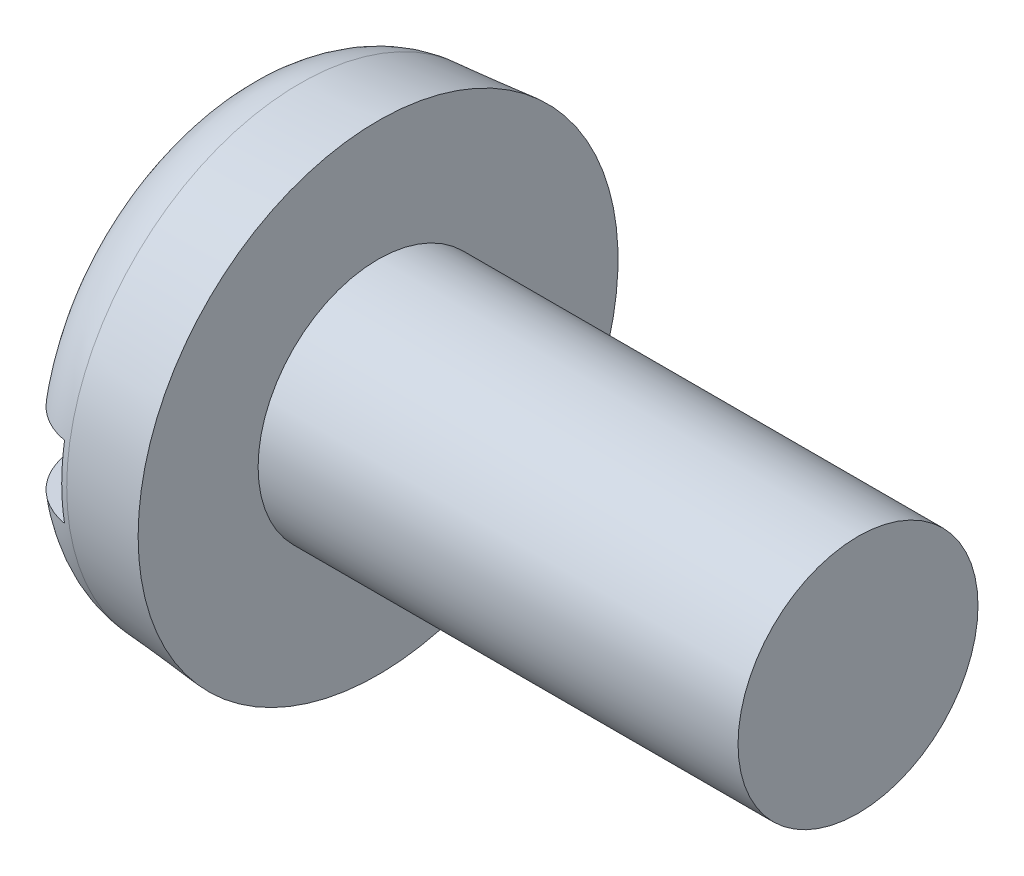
ISO-10303-21;
HEADER;
FILE_DESCRIPTION(('STEP AP214'),'2;1');
FILE_NAME('part.step','',(''),(''),'','','');
FILE_SCHEMA(('AUTOMOTIVE_DESIGN { 1 0 10303 214 1 1 1 1 }'));
ENDSEC;
DATA;
#1=APPLICATION_CONTEXT('core data for automotive mechanical design processes');
#2=APPLICATION_PROTOCOL_DEFINITION('international standard','automotive_design',2000,#1);
#3=PRODUCT_CONTEXT('',#1,'mechanical');
#4=PRODUCT('Part','Part','',(#3));
#5=PRODUCT_RELATED_PRODUCT_CATEGORY('part','',(#4));
#6=PRODUCT_DEFINITION_FORMATION('','',#4);
#7=PRODUCT_DEFINITION_CONTEXT('part definition',#1,'design');
#8=PRODUCT_DEFINITION('design','',#6,#7);
#9=PRODUCT_DEFINITION_SHAPE('','',#8);
#10=(LENGTH_UNIT() NAMED_UNIT(*) SI_UNIT(.MILLI.,.METRE.));
#11=(NAMED_UNIT(*) PLANE_ANGLE_UNIT() SI_UNIT($,.RADIAN.));
#12=(NAMED_UNIT(*) SI_UNIT($,.STERADIAN.) SOLID_ANGLE_UNIT());
#13=UNCERTAINTY_MEASURE_WITH_UNIT(LENGTH_MEASURE(1.E-05),#10,'distance_accuracy_value','');
#14=(GEOMETRIC_REPRESENTATION_CONTEXT(3) GLOBAL_UNCERTAINTY_ASSIGNED_CONTEXT((#13)) GLOBAL_UNIT_ASSIGNED_CONTEXT((#10,
#11,#12)) REPRESENTATION_CONTEXT('',''));
#15=CARTESIAN_POINT('',(0.,0.,0.));
#16=DIRECTION('',(0.,0.,1.));
#17=DIRECTION('',(1.,0.,0.));
#18=AXIS2_PLACEMENT_3D('',#15,#16,#17);
#19=CARTESIAN_POINT('',(0.,0.,0.));
#20=DIRECTION('',(-1.,0.,0.));
#21=DIRECTION('',(0.,0.,1.));
#22=AXIS2_PLACEMENT_3D('',#19,#20,#21);
#23=PLANE('',#22);
#24=DIRECTION('',(0.,0.,-1.));
#25=VECTOR('',#24,1.);
#26=CARTESIAN_POINT('',(0.,0.599999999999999,4.));
#27=LINE('',#26,#25);
#28=CARTESIAN_POINT('',(0.,0.599999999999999,2.62267277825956));
#29=VERTEX_POINT('',#28);
#30=CARTESIAN_POINT('',(0.,0.599999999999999,-2.62267277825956));
#31=VERTEX_POINT('',#30);
#32=EDGE_CURVE('E85',#29,#31,#27,.T.);
#33=ORIENTED_EDGE('',*,*,#32,.F.);
#34=CARTESIAN_POINT('',(0.,0.,0.));
#35=DIRECTION('',(-1.,0.,0.));
#36=DIRECTION('',(0.,0.,1.));
#37=AXIS2_PLACEMENT_3D('',#34,#35,#36);
#38=CIRCLE('',#37,2.69042979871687);
#39=EDGE_CURVE('E91',#29,#31,#38,.T.);
#40=ORIENTED_EDGE('',*,*,#39,.T.);
#41=EDGE_LOOP('',(#33,#40));
#42=FACE_BOUND('',#41,.T.);
#43=ADVANCED_FACE('F32',(#42),#23,.T.);
#44=CARTESIAN_POINT('',(-25.4,0.,0.));
#45=DIRECTION('',(-1.,0.,0.));
#46=DIRECTION('',(0.,0.,1.));
#47=AXIS2_PLACEMENT_3D('',#44,#45,#46);
#48=CYLINDRICAL_SURFACE('',#47,2.);
#49=CARTESIAN_POINT('',(10.4,0.,0.));
#50=DIRECTION('',(-1.,0.,0.));
#51=DIRECTION('',(0.,0.,1.));
#52=AXIS2_PLACEMENT_3D('',#49,#50,#51);
#53=CIRCLE('',#52,2.);
#54=CARTESIAN_POINT('',(10.4,0.,2.));
#55=VERTEX_POINT('',#54);
#56=EDGE_CURVE('E92',#55,#55,#53,.T.);
#57=ORIENTED_EDGE('',*,*,#56,.T.);
#58=EDGE_LOOP('',(#57));
#59=FACE_BOUND('',#58,.T.);
#60=CARTESIAN_POINT('',(2.4,0.,0.));
#61=DIRECTION('',(-1.,0.,0.));
#62=DIRECTION('',(0.,0.,1.));
#63=AXIS2_PLACEMENT_3D('',#60,#61,#62);
#64=CIRCLE('',#63,2.);
#65=CARTESIAN_POINT('',(2.4,0.,2.));
#66=VERTEX_POINT('',#65);
#67=EDGE_CURVE('E149',#66,#66,#64,.T.);
#68=ORIENTED_EDGE('',*,*,#67,.F.);
#69=EDGE_LOOP('',(#68));
#70=FACE_BOUND('',#69,.T.);
#71=ADVANCED_FACE('F137',(#59,#70),#48,.T.);
#72=CARTESIAN_POINT('',(10.4,2.,0.));
#73=DIRECTION('',(1.,0.,0.));
#74=DIRECTION('',(0.,0.,-1.));
#75=AXIS2_PLACEMENT_3D('',#72,#73,#74);
#76=PLANE('',#75);
#77=ORIENTED_EDGE('',*,*,#56,.F.);
#78=EDGE_LOOP('',(#77));
#79=FACE_BOUND('',#78,.T.);
#80=ADVANCED_FACE('F135',(#79),#76,.T.);
#81=DIRECTION('',(0.,0.,1.));
#82=VECTOR('',#81,1.);
#83=CARTESIAN_POINT('',(0.,-0.599999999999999,-4.));
#84=LINE('',#83,#82);
#85=CARTESIAN_POINT('',(0.,-0.6,-2.62267277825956));
#86=VERTEX_POINT('',#85);
#87=CARTESIAN_POINT('',(0.,-0.6,2.62267277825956));
#88=VERTEX_POINT('',#87);
#89=EDGE_CURVE('E76',#86,#88,#84,.T.);
#90=ORIENTED_EDGE('',*,*,#89,.F.);
#91=EDGE_CURVE('E83',#86,#88,#38,.T.);
#92=ORIENTED_EDGE('',*,*,#91,.T.);
#93=EDGE_LOOP('',(#90,#92));
#94=FACE_BOUND('',#93,.T.);
#95=ADVANCED_FACE('F82',(#94),#23,.T.);
#96=CARTESIAN_POINT('',(0.,0.,0.));
#97=DIRECTION('',(1.,0.,0.));
#98=DIRECTION('',(0.,0.,-1.));
#99=AXIS2_PLACEMENT_3D('',#96,#97,#98);
#100=CONICAL_SURFACE('',#99,3.79002720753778,0.0872664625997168);
#101=CARTESIAN_POINT('',(1.09541310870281,0.,0.));
#102=DIRECTION('',(-1.,0.,0.));
#103=DIRECTION('',(0.,0.,1.));
#104=AXIS2_PLACEMENT_3D('',#101,#102,#103);
#105=CIRCLE('',#104,3.88586343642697);
#106=CARTESIAN_POINT('',(1.09541310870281,0.,3.88586343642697));
#107=VERTEX_POINT('',#106);
#108=EDGE_CURVE('E95',#107,#107,#105,.F.);
#109=ORIENTED_EDGE('',*,*,#108,.T.);
#110=EDGE_LOOP('',(#109));
#111=FACE_BOUND('',#110,.T.);
#112=CARTESIAN_POINT('',(2.4,0.,0.));
#113=DIRECTION('',(-1.,0.,0.));
#114=DIRECTION('',(0.,0.,1.));
#115=AXIS2_PLACEMENT_3D('',#112,#113,#114);
#116=CIRCLE('',#115,4.);
#117=CARTESIAN_POINT('',(2.4,0.,4.));
#118=VERTEX_POINT('',#117);
#119=EDGE_CURVE('E97',#118,#118,#116,.T.);
#120=ORIENTED_EDGE('',*,*,#119,.T.);
#121=EDGE_LOOP('',(#120));
#122=FACE_BOUND('',#121,.T.);
#123=ADVANCED_FACE('F128',(#111,#122),#100,.T.);
#124=CARTESIAN_POINT('',(2.4,2.,0.));
#125=DIRECTION('',(-1.,0.,0.));
#126=DIRECTION('',(0.,0.,1.));
#127=AXIS2_PLACEMENT_3D('',#124,#125,#126);
#128=PLANE('',#127);
#129=ORIENTED_EDGE('',*,*,#119,.F.);
#130=EDGE_LOOP('',(#129));
#131=FACE_BOUND('',#130,.T.);
#132=ORIENTED_EDGE('',*,*,#67,.T.);
#133=EDGE_LOOP('',(#132));
#134=FACE_BOUND('',#133,.T.);
#135=ADVANCED_FACE('F124',(#131,#134),#128,.F.);
#136=CARTESIAN_POINT('',(1.2,0.,0.));
#137=DIRECTION('',(-1.,0.,0.));
#138=DIRECTION('',(0.,0.,1.));
#139=AXIS2_PLACEMENT_3D('',#136,#137,#138);
#140=TOROIDAL_SURFACE('',#139,2.69042979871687,1.2);
#141=CARTESIAN_POINT('',(0.3865043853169,0.599999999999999,-3.52185650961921));
#142=CARTESIAN_POINT('',(0.435468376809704,0.599999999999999,-3.56765543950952));
#143=CARTESIAN_POINT('',(0.48830443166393,0.599999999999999,-3.60938194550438));
#144=CARTESIAN_POINT('',(0.600265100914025,0.599999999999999,-3.68342203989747));
#145=CARTESIAN_POINT('',(0.659396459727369,0.599999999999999,-3.71572539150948));
#146=CARTESIAN_POINT('',(0.782252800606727,0.599999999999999,-3.76991557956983));
#147=CARTESIAN_POINT('',(0.845977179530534,0.599999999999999,-3.79180378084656));
#148=CARTESIAN_POINT('',(0.976191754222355,0.599999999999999,-3.82450279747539));
#149=CARTESIAN_POINT('',(1.04268130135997,0.599999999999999,-3.83531619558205));
#150=CARTESIAN_POINT('',(1.1761990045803,0.599999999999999,-3.84552483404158));
#151=CARTESIAN_POINT('',(1.2432228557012,0.599999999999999,-3.84497642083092));
#152=CARTESIAN_POINT('',(1.37622462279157,0.599999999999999,-3.83261582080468));
#153=CARTESIAN_POINT('',(1.44220252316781,0.599999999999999,-3.82080346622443));
#154=CARTESIAN_POINT('',(1.57113854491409,0.599999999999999,-3.7862937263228));
#155=CARTESIAN_POINT('',(1.63410108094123,0.599999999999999,-3.76361282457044));
#156=CARTESIAN_POINT('',(1.75534617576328,0.599999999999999,-3.70804459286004));
#157=CARTESIAN_POINT('',(1.81362870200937,0.599999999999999,-3.67515719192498));
#158=CARTESIAN_POINT('',(1.92413366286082,0.599999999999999,-3.5999836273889));
#159=CARTESIAN_POINT('',(1.97632984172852,0.599999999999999,-3.55765888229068));
#160=CARTESIAN_POINT('',(2.07296076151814,0.599999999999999,-3.46492588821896));
#161=CARTESIAN_POINT('',(2.11739523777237,0.599999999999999,-3.4145173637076));
#162=CARTESIAN_POINT('',(2.19773705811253,0.599999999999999,-3.30652404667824));
#163=CARTESIAN_POINT('',(2.2335546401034,0.599999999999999,-3.24887250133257));
#164=CARTESIAN_POINT('',(2.29517588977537,0.599999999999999,-3.12844912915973));
#165=CARTESIAN_POINT('',(2.32097889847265,0.599999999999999,-3.06567696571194));
#166=CARTESIAN_POINT('',(2.36230436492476,0.599999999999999,-2.93572304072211));
#167=CARTESIAN_POINT('',(2.37765465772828,0.599999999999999,-2.86848656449));
#168=CARTESIAN_POINT('',(2.39710654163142,0.599999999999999,-2.73240889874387));
#169=CARTESIAN_POINT('',(2.40120699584,0.599999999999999,-2.66356754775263));
#170=CARTESIAN_POINT('',(2.39814758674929,0.599999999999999,-2.52464946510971));
#171=CARTESIAN_POINT('',(2.39074269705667,0.599999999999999,-2.45457815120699));
#172=CARTESIAN_POINT('',(2.36454808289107,0.599999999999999,-2.31659764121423));
#173=CARTESIAN_POINT('',(2.34575688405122,0.599999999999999,-2.24868872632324));
#174=CARTESIAN_POINT('',(2.29682890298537,0.599999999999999,-2.11531585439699));
#175=CARTESIAN_POINT('',(2.26644200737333,0.599999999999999,-2.04994358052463));
#176=CARTESIAN_POINT('',(2.19524076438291,0.599999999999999,-1.92513363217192));
#177=CARTESIAN_POINT('',(2.15442449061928,0.599999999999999,-1.86569705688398));
#178=CARTESIAN_POINT('',(2.06294283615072,0.599999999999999,-1.75389115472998));
#179=CARTESIAN_POINT('',(2.01217853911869,0.599999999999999,-1.70160258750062));
#180=CARTESIAN_POINT('',(1.90235992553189,0.599999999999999,-1.60657192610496));
#181=CARTESIAN_POINT('',(1.84330597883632,0.599999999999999,-1.56382940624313));
#182=CARTESIAN_POINT('',(1.72028944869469,0.599999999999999,-1.49071034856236));
#183=CARTESIAN_POINT('',(1.65652070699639,0.599999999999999,-1.46000898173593));
#184=CARTESIAN_POINT('',(1.52445964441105,0.599999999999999,-1.41076217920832));
#185=CARTESIAN_POINT('',(1.45617085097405,0.599999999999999,-1.39220738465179));
#186=CARTESIAN_POINT('',(1.32258878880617,0.599999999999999,-1.3692588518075));
#187=CARTESIAN_POINT('',(1.25746124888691,0.599999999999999,-1.36389765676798));
#188=CARTESIAN_POINT('',(1.12729576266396,0.599999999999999,-1.36480396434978));
#189=CARTESIAN_POINT('',(1.06225779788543,0.599999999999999,-1.37106853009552));
#190=CARTESIAN_POINT('',(0.937361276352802,0.599999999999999,-1.39427975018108));
#191=CARTESIAN_POINT('',(0.877403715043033,0.599999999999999,-1.41070181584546));
#192=CARTESIAN_POINT('',(0.760914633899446,0.599999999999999,-1.45296891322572));
#193=CARTESIAN_POINT('',(0.704383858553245,0.599999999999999,-1.47881598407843));
#194=CARTESIAN_POINT('',(0.59370506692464,0.599999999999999,-1.54020998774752));
#195=CARTESIAN_POINT('',(0.539760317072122,0.599999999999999,-1.57612236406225));
#196=CARTESIAN_POINT('',(0.438104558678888,0.599999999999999,-1.65588570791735));
#197=CARTESIAN_POINT('',(0.390395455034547,0.599999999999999,-1.69973909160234));
#198=CARTESIAN_POINT('',(0.298820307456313,0.599999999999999,-1.79776253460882));
#199=CARTESIAN_POINT('',(0.255521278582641,0.599999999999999,-1.85246315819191));
#200=CARTESIAN_POINT('',(0.178283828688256,0.599999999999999,-1.96812037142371));
#201=CARTESIAN_POINT('',(0.144347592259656,0.599999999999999,-2.02907841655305));
#202=CARTESIAN_POINT('',(0.0855336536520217,0.599999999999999,-2.15824220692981));
#203=CARTESIAN_POINT('',(0.0610804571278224,0.599999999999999,-2.22664188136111));
#204=CARTESIAN_POINT('',(0.0240295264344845,0.599999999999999,-2.36658228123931));
#205=CARTESIAN_POINT('',(0.0114315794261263,0.599999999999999,-2.43812295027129));
#206=CARTESIAN_POINT('',(-0.00140349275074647,0.599999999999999,-2.58214276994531));
#207=CARTESIAN_POINT('',(-0.00166960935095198,0.599999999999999,-2.65461931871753));
#208=CARTESIAN_POINT('',(0.0102529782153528,0.599999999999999,-2.79856484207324));
#209=CARTESIAN_POINT('',(0.0224436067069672,0.599999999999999,-2.87003365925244));
#210=CARTESIAN_POINT('',(0.0586721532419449,0.599999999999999,-3.00828260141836));
#211=CARTESIAN_POINT('',(0.082454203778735,0.599999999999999,-3.07512990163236));
#212=CARTESIAN_POINT('',(0.141152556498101,0.599999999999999,-3.20367573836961));
#213=CARTESIAN_POINT('',(0.176053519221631,0.599999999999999,-3.26538122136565));
#214=CARTESIAN_POINT('',(0.240740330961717,0.599999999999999,-3.35956174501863));
#215=CARTESIAN_POINT('',(0.267410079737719,0.599999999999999,-3.39421743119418));
#216=CARTESIAN_POINT('',(0.324340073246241,0.599999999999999,-3.46044388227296));
#217=CARTESIAN_POINT('',(0.354600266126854,0.599999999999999,-3.49201469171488));
#218=CARTESIAN_POINT('',(0.3865043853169,0.599999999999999,-3.52185650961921));
#219=B_SPLINE_CURVE_WITH_KNOTS('',3,(#141,#142,#143,#144,#145,#146,#147,#148,#149,#150,#151,
#152,#153,#154,#155,#156,#157,#158,#159,#160,#161,#162,#163,#164,#165,#166,#167,#168,#169,#170,
#171,#172,#173,#174,#175,#176,#177,#178,#179,#180,#181,#182,#183,#184,#185,#186,#187,#188,#189,
#190,#191,#192,#193,#194,#195,#196,#197,#198,#199,#200,#201,#202,#203,#204,#205,#206,#207,#208,
#209,#210,#211,#212,#213,#214,#215,#216,#217,#218),.UNSPECIFIED.,.T.,.F.,(4,2,2,2,2,2,2,2,2,2,2,
2,2,2,2,2,2,2,2,2,2,2,2,2,2,2,2,2,2,2,2,2,2,2,2,2,2,2,4),(0.,0.200976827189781,
0.402171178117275,0.603339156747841,0.804460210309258,1.0045840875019,1.2047109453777,
1.40453524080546,1.60436092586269,1.80501901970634,2.00568395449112,2.2083565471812,
2.41104247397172,2.61699090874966,2.82296015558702,3.03337636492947,3.24381982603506,
3.45908552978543,3.67439102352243,3.8919572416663,4.10951375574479,4.32071351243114,
4.53175034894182,4.72677835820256,4.92175710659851,5.10742155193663,5.29312619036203,
5.48672044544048,5.68037370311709,5.88873369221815,6.09714225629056,6.31402614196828,
6.53090613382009,6.74727622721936,6.96367975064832,7.17550906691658,7.38704740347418,
7.51800243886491,7.64895558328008),.UNSPECIFIED.);
#220=CARTESIAN_POINT('',(1.,0.599999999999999,-3.8268957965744));
#221=VERTEX_POINT('',#220);
#222=EDGE_CURVE('E11',#31,#221,#219,.T.);
#223=ORIENTED_EDGE('',*,*,#222,.F.);
#224=ORIENTED_EDGE('',*,*,#39,.F.);
#225=CARTESIAN_POINT('',(0.568676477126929,0.599999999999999,1.55841219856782));
#226=CARTESIAN_POINT('',(0.622454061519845,0.599999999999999,1.52276443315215));
#227=CARTESIAN_POINT('',(0.679085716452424,0.599999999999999,1.49137245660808));
#228=CARTESIAN_POINT('',(0.796770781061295,0.599999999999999,1.43831139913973));
#229=CARTESIAN_POINT('',(0.857825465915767,0.599999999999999,1.41664513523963));
#230=CARTESIAN_POINT('',(0.982921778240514,0.599999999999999,1.38402811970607));
#231=CARTESIAN_POINT('',(1.04697051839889,0.599999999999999,1.37310440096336));
#232=CARTESIAN_POINT('',(1.17597937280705,0.599999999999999,1.36268675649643));
#233=CARTESIAN_POINT('',(1.24093916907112,0.599999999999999,1.36318893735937));
#234=CARTESIAN_POINT('',(1.36722529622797,0.599999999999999,1.37533615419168));
#235=CARTESIAN_POINT('',(1.42859438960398,0.599999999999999,1.38654477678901));
#236=CARTESIAN_POINT('',(1.54865022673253,0.599999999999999,1.41889802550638));
#237=CARTESIAN_POINT('',(1.60733638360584,0.599999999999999,1.44004481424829));
#238=CARTESIAN_POINT('',(1.72180457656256,0.599999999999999,1.49189888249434));
#239=CARTESIAN_POINT('',(1.77749881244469,0.599999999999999,1.52279911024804));
#240=CARTESIAN_POINT('',(1.88340638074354,0.599999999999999,1.59287167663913));
#241=CARTESIAN_POINT('',(1.93361816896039,0.599999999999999,1.63204633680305));
#242=CARTESIAN_POINT('',(2.03113053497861,0.599999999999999,1.7207614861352));
#243=CARTESIAN_POINT('',(2.07792119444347,0.599999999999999,1.77086293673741));
#244=CARTESIAN_POINT('',(2.16295007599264,0.599999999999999,1.87786529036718));
#245=CARTESIAN_POINT('',(2.20118595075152,0.599999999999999,1.93476805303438));
#246=CARTESIAN_POINT('',(2.26997158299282,0.599999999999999,2.05705672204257));
#247=CARTESIAN_POINT('',(2.30000838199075,0.599999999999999,2.12273201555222));
#248=CARTESIAN_POINT('',(2.34872218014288,0.599999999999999,2.25817360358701));
#249=CARTESIAN_POINT('',(2.36739836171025,0.599999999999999,2.32794019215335));
#250=CARTESIAN_POINT('',(2.39284815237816,0.599999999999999,2.47012141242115));
#251=CARTESIAN_POINT('',(2.3995382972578,0.599999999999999,2.54255105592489));
#252=CARTESIAN_POINT('',(2.40041533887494,0.599999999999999,2.68749005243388));
#253=CARTESIAN_POINT('',(2.39460324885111,0.599999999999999,2.75999939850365));
#254=CARTESIAN_POINT('',(2.37072428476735,0.599999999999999,2.90156578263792));
#255=CARTESIAN_POINT('',(2.35289092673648,0.599999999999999,2.97066215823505));
#256=CARTESIAN_POINT('',(2.3055955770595,0.599999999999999,3.10475609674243));
#257=CARTESIAN_POINT('',(2.2761350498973,0.599999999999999,3.16975417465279));
#258=CARTESIAN_POINT('',(2.20718370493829,0.599999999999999,3.29217559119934));
#259=CARTESIAN_POINT('',(2.16794580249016,0.599999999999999,3.34974141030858));
#260=CARTESIAN_POINT('',(2.08018656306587,0.599999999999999,3.45730019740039));
#261=CARTESIAN_POINT('',(2.03166624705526,0.599999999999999,3.50729399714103));
#262=CARTESIAN_POINT('',(1.92773605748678,0.599999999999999,3.59728886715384));
#263=CARTESIAN_POINT('',(1.87247613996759,0.599999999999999,3.63746317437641));
#264=CARTESIAN_POINT('',(1.75592540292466,0.599999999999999,3.70782235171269));
#265=CARTESIAN_POINT('',(1.69463504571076,0.599999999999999,3.73800798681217));
#266=CARTESIAN_POINT('',(1.5686108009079,0.599999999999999,3.78714975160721));
#267=CARTESIAN_POINT('',(1.50393088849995,0.599999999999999,3.80624437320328));
#268=CARTESIAN_POINT('',(1.37227430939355,0.599999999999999,3.83322369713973));
#269=CARTESIAN_POINT('',(1.30529774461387,0.599999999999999,3.84110889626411));
#270=CARTESIAN_POINT('',(1.17141837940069,0.599999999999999,3.845417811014));
#271=CARTESIAN_POINT('',(1.10451797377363,0.599999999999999,3.841916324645));
#272=CARTESIAN_POINT('',(0.972258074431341,0.599999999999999,3.82372114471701));
#273=CARTESIAN_POINT('',(0.906898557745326,0.599999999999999,3.80902761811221));
#274=CARTESIAN_POINT('',(0.779620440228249,0.599999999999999,3.76890152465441));
#275=CARTESIAN_POINT('',(0.717699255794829,0.599999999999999,3.74347714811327));
#276=CARTESIAN_POINT('',(0.598976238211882,0.599999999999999,3.68264222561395));
#277=CARTESIAN_POINT('',(0.542174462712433,0.599999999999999,3.64723156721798));
#278=CARTESIAN_POINT('',(0.434989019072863,0.599999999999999,3.56726339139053));
#279=CARTESIAN_POINT('',(0.384638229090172,0.599999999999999,3.5226618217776));
#280=CARTESIAN_POINT('',(0.292043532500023,0.599999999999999,3.42571932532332));
#281=CARTESIAN_POINT('',(0.249799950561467,0.599999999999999,3.37337808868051));
#282=CARTESIAN_POINT('',(0.174110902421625,0.599999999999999,3.26185326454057));
#283=CARTESIAN_POINT('',(0.140765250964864,0.599999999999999,3.20260196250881));
#284=CARTESIAN_POINT('',(0.0843091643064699,0.599999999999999,3.07941230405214));
#285=CARTESIAN_POINT('',(0.0611994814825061,0.599999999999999,3.01547360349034));
#286=CARTESIAN_POINT('',(0.0254327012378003,0.599999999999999,2.88357716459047));
#287=CARTESIAN_POINT('',(0.0129588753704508,0.599999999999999,2.81556976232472));
#288=CARTESIAN_POINT('',(-0.000658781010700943,0.599999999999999,2.67843562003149));
#289=CARTESIAN_POINT('',(-0.00180186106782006,0.599999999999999,2.60930880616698));
#290=CARTESIAN_POINT('',(0.00723867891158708,0.599999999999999,2.47027110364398));
#291=CARTESIAN_POINT('',(0.0176724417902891,0.599999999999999,2.40037650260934));
#292=CARTESIAN_POINT('',(0.0498636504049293,0.599999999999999,2.2632278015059));
#293=CARTESIAN_POINT('',(0.0716251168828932,0.599999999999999,2.19597464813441));
#294=CARTESIAN_POINT('',(0.126425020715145,0.599999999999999,2.06442921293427));
#295=CARTESIAN_POINT('',(0.159709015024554,0.599999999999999,2.00023925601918));
#296=CARTESIAN_POINT('',(0.236484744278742,0.599999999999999,1.87833288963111));
#297=CARTESIAN_POINT('',(0.279968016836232,0.599999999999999,1.82061117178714));
#298=CARTESIAN_POINT('',(0.363480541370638,0.599999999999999,1.7273106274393));
#299=CARTESIAN_POINT('',(0.401461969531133,0.599999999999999,1.68987927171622));
#300=CARTESIAN_POINT('',(0.481873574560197,0.599999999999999,1.62013708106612));
#301=CARTESIAN_POINT('',(0.524303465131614,0.599999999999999,1.58782591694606));
#302=CARTESIAN_POINT('',(0.568676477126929,0.599999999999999,1.55841219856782));
#303=B_SPLINE_CURVE_WITH_KNOTS('',3,(#225,#226,#227,#228,#229,#230,#231,#232,#233,#234,#235,
#236,#237,#238,#239,#240,#241,#242,#243,#244,#245,#246,#247,#248,#249,#250,#251,#252,#253,#254,
#255,#256,#257,#258,#259,#260,#261,#262,#263,#264,#265,#266,#267,#268,#269,#270,#271,#272,#273,
#274,#275,#276,#277,#278,#279,#280,#281,#282,#283,#284,#285,#286,#287,#288,#289,#290,#291,#292,
#293,#294,#295,#296,#297,#298,#299,#300,#301,#302),.UNSPECIFIED.,.T.,.F.,(4,2,2,2,2,2,2,2,2,2,2,
2,2,2,2,2,2,2,2,2,2,2,2,2,2,2,2,2,2,2,2,2,2,2,2,2,2,2,4),(0.,0.193385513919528,
0.386827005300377,0.580754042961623,0.774615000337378,0.960896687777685,1.14721893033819,
1.33748625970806,1.52780704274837,1.73256769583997,1.93738446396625,2.15302491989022,
2.3686808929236,2.58583282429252,2.80296715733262,3.01600070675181,3.22900743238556,
3.43699107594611,3.64495185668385,3.84892478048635,4.05288207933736,4.25423457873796,
4.45557815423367,4.65560180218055,4.85562246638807,5.05549074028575,5.25536126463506,
5.45621303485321,5.6570728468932,5.86009921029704,6.06314049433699,6.26961358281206,
6.47610034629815,6.68713711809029,6.89824884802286,7.11416888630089,7.3299104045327,
7.4894871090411,7.64905354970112),.UNSPECIFIED.);
#304=CARTESIAN_POINT('',(1.,0.599999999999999,3.8268957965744));
#305=VERTEX_POINT('',#304);
#306=EDGE_CURVE('E109',#305,#29,#303,.T.);
#307=ORIENTED_EDGE('',*,*,#306,.F.);
#308=CARTESIAN_POINT('',(1.,0.,0.));
#309=DIRECTION('',(-1.,0.,0.));
#310=DIRECTION('',(0.,0.,1.));
#311=AXIS2_PLACEMENT_3D('',#308,#309,#310);
#312=CIRCLE('',#311,3.8736457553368);
#313=CARTESIAN_POINT('',(1.,-0.600000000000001,3.8268957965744));
#314=VERTEX_POINT('',#313);
#315=EDGE_CURVE('E103',#305,#314,#312,.F.);
#316=ORIENTED_EDGE('',*,*,#315,.T.);
#317=CARTESIAN_POINT('',(0.568676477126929,-0.6,1.55841219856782));
#318=CARTESIAN_POINT('',(0.509332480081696,-0.6,1.59775463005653));
#319=CARTESIAN_POINT('',(0.453379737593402,-0.6,1.64234041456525));
#320=CARTESIAN_POINT('',(0.349719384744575,-0.6,1.74035526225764));
#321=CARTESIAN_POINT('',(0.302029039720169,-0.6,1.79380239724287));
#322=CARTESIAN_POINT('',(0.216237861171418,-0.6,1.90774469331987));
#323=CARTESIAN_POINT('',(0.178118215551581,-0.6,1.96822568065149));
#324=CARTESIAN_POINT('',(0.112363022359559,-0.6,2.0946004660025));
#325=CARTESIAN_POINT('',(0.0847225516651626,-0.6,2.16049170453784));
#326=CARTESIAN_POINT('',(0.0402688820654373,-0.6,2.29725613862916));
#327=CARTESIAN_POINT('',(0.0236758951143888,-0.6,2.36820113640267));
#328=CARTESIAN_POINT('',(0.00278349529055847,-0.6,2.51189141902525));
#329=CARTESIAN_POINT('',(-0.00151505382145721,-0.6,2.58463683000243));
#330=CARTESIAN_POINT('',(0.00243750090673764,-0.6,2.72894600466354));
#331=CARTESIAN_POINT('',(0.010543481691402,-0.6,2.80051368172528));
#332=CARTESIAN_POINT('',(0.0389520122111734,-0.6,2.94118836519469));
#333=CARTESIAN_POINT('',(0.0592529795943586,-0.6,3.01029568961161));
#334=CARTESIAN_POINT('',(0.110960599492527,-0.6,3.1423581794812));
#335=CARTESIAN_POINT('',(0.142096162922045,-0.6,3.20541948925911));
#336=CARTESIAN_POINT('',(0.214736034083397,-0.6,3.32525905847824));
#337=CARTESIAN_POINT('',(0.256239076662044,-0.6,3.38203808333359));
#338=CARTESIAN_POINT('',(0.347460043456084,-0.6,3.48641848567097));
#339=CARTESIAN_POINT('',(0.396982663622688,-0.6,3.53419059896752));
#340=CARTESIAN_POINT('',(0.503454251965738,-0.6,3.62058393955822));
#341=CARTESIAN_POINT('',(0.560402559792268,-0.600000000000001,3.6592059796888));
#342=CARTESIAN_POINT('',(0.67915616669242,-0.600000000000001,3.72559524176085));
#343=CARTESIAN_POINT('',(0.740873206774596,-0.600000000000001,3.75352040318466));
#344=CARTESIAN_POINT('',(0.868147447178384,-0.600000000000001,3.79850563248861));
#345=CARTESIAN_POINT('',(0.933704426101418,-0.600000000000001,3.81556632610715));
#346=CARTESIAN_POINT('',(1.06616217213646,-0.600000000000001,3.83820251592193));
#347=CARTESIAN_POINT('',(1.13304550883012,-0.600000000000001,3.84388011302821));
#348=CARTESIAN_POINT('',(1.26681198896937,-0.600000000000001,3.84388783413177));
#349=CARTESIAN_POINT('',(1.33369513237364,-0.600000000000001,3.83821825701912));
#350=CARTESIAN_POINT('',(1.46534857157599,-0.600000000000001,3.81573676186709));
#351=CARTESIAN_POINT('',(1.5301247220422,-0.600000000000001,3.79895909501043));
#352=CARTESIAN_POINT('',(1.65595122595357,-0.600000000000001,3.75479405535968));
#353=CARTESIAN_POINT('',(1.7170015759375,-0.600000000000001,3.72740667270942));
#354=CARTESIAN_POINT('',(1.83382644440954,-0.600000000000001,3.66274505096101));
#355=CARTESIAN_POINT('',(1.88958679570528,-0.6,3.62544522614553));
#356=CARTESIAN_POINT('',(1.99411858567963,-0.6,3.54208564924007));
#357=CARTESIAN_POINT('',(2.04288982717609,-0.6,3.49602565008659));
#358=CARTESIAN_POINT('',(2.1325144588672,-0.6,3.39605796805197));
#359=CARTESIAN_POINT('',(2.17329813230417,-0.6,3.34208780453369));
#360=CARTESIAN_POINT('',(2.245373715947,-0.6,3.22814724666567));
#361=CARTESIAN_POINT('',(2.27666509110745,-0.6,3.16817651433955));
#362=CARTESIAN_POINT('',(2.32937247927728,-0.6,3.04302336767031));
#363=CARTESIAN_POINT('',(2.35063955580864,-0.6,2.97777826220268));
#364=CARTESIAN_POINT('',(2.3821555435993,-0.6,2.84468257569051));
#365=CARTESIAN_POINT('',(2.39240345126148,-0.6,2.77683175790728));
#366=CARTESIAN_POINT('',(2.40182781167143,-0.6,2.6389851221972));
#367=CARTESIAN_POINT('',(2.40077563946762,-0.6,2.56897370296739));
#368=CARTESIAN_POINT('',(2.38721389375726,-0.6,2.43007140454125));
#369=CARTESIAN_POINT('',(2.37470291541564,-0.6,2.36118066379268));
#370=CARTESIAN_POINT('',(2.33824897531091,-0.6,2.22476443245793));
#371=CARTESIAN_POINT('',(2.31404566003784,-0.6,2.15730848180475));
#372=CARTESIAN_POINT('',(2.25484108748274,-0.6,2.02730649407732));
#373=CARTESIAN_POINT('',(2.21983804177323,-0.6,1.96476127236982));
#374=CARTESIAN_POINT('',(2.13932874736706,-0.6,1.8453529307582));
#375=CARTESIAN_POINT('',(2.09366234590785,-0.6,1.78859760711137));
#376=CARTESIAN_POINT('',(1.99331431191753,-0.6,1.68367587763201));
#377=CARTESIAN_POINT('',(1.93863170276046,-0.6,1.63551040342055));
#378=CARTESIAN_POINT('',(1.82254625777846,-0.6,1.55016942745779));
#379=CARTESIAN_POINT('',(1.7612597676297,-0.6,1.51283623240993));
#380=CARTESIAN_POINT('',(1.6329601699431,-0.6,1.44984263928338));
#381=CARTESIAN_POINT('',(1.56595104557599,-0.6,1.42417419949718));
#382=CARTESIAN_POINT('',(1.43290073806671,-0.6,1.38720166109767));
#383=CARTESIAN_POINT('',(1.36709528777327,-0.6,1.37505067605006));
#384=CARTESIAN_POINT('',(1.23436273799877,-0.6,1.3628486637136));
#385=CARTESIAN_POINT('',(1.16743586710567,-0.6,1.36279519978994));
#386=CARTESIAN_POINT('',(1.03904581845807,-0.6,1.37438428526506));
#387=CARTESIAN_POINT('',(0.97751125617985,-0.6,1.38526326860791));
#388=CARTESIAN_POINT('',(0.857136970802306,-0.6,1.41700902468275));
#389=CARTESIAN_POINT('',(0.79829431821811,-0.6,1.43786464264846));
#390=CARTESIAN_POINT('',(0.711456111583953,-0.6,1.47666141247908));
#391=CARTESIAN_POINT('',(0.681965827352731,-0.6,1.49136190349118));
#392=CARTESIAN_POINT('',(0.624300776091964,-0.6,1.52313858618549));
#393=CARTESIAN_POINT('',(0.596125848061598,-0.6,1.54021448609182));
#394=CARTESIAN_POINT('',(0.568676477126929,-0.6,1.55841219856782));
#395=B_SPLINE_CURVE_WITH_KNOTS('',3,(#317,#318,#319,#320,#321,#322,#323,#324,#325,#326,#327,
#328,#329,#330,#331,#332,#333,#334,#335,#336,#337,#338,#339,#340,#341,#342,#343,#344,#345,#346,
#347,#348,#349,#350,#351,#352,#353,#354,#355,#356,#357,#358,#359,#360,#361,#362,#363,#364,#365,
#366,#367,#368,#369,#370,#371,#372,#373,#374,#375,#376,#377,#378,#379,#380,#381,#382,#383,#384,
#385,#386,#387,#388,#389,#390,#391,#392,#393,#394),.UNSPECIFIED.,.T.,.F.,(4,2,2,2,2,2,2,2,2,2,2,
2,2,2,2,2,2,2,2,2,2,2,2,2,2,2,2,2,2,2,2,2,2,2,2,2,2,2,4),(0.,0.2134759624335,0.427392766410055,
0.640885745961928,0.854278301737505,1.07180637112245,1.28934972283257,1.50436737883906,
1.71935714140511,1.92931435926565,2.13924596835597,2.34467456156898,2.55008489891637,
2.75233330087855,2.95457005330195,3.15498457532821,3.355393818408,3.55518797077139,
3.75498230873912,3.95529744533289,4.15561823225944,4.35761633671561,4.55962582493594,
4.76454879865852,4.96949043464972,5.17858616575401,5.38770753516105,5.60171647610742,
5.815760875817,6.03325422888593,6.25077115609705,6.46494128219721,6.67896353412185,
6.87865214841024,7.07830054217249,7.26491113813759,7.4513135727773,7.55006829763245,
7.64881090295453),.UNSPECIFIED.);
#396=EDGE_CURVE('E90',#88,#314,#395,.T.);
#397=ORIENTED_EDGE('',*,*,#396,.F.);
#398=ORIENTED_EDGE('',*,*,#91,.F.);
#399=CARTESIAN_POINT('',(0.3865043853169,-0.6,-3.52185650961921));
#400=CARTESIAN_POINT('',(0.336558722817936,-0.6,-3.47513075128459));
#401=CARTESIAN_POINT('',(0.290567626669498,-0.6,-3.42409544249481));
#402=CARTESIAN_POINT('',(0.207816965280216,-0.6,-3.31495007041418));
#403=CARTESIAN_POINT('',(0.171070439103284,-0.6,-3.2568301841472));
#404=CARTESIAN_POINT('',(0.107859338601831,-0.6,-3.13533662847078));
#405=CARTESIAN_POINT('',(0.081381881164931,-0.6,-3.07196966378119));
#406=CARTESIAN_POINT('',(0.0392838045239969,-0.6,-2.94175448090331));
#407=CARTESIAN_POINT('',(0.0236604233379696,-0.6,-2.87490715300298));
#408=CARTESIAN_POINT('',(0.00341113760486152,-0.6,-2.73858284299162));
#409=CARTESIAN_POINT('',(-0.00105268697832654,-0.6,-2.66908182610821));
#410=CARTESIAN_POINT('',(0.00147102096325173,-0.6,-2.53028718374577));
#411=CARTESIAN_POINT('',(0.00846038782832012,-0.6,-2.46099359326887));
#412=CARTESIAN_POINT('',(0.0338721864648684,-0.6,-2.3228723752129));
#413=CARTESIAN_POINT('',(0.052556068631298,-0.6,-2.25409284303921));
#414=CARTESIAN_POINT('',(0.100979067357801,-0.6,-2.12053875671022));
#415=CARTESIAN_POINT('',(0.13071979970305,-0.6,-2.05576478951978));
#416=CARTESIAN_POINT('',(0.201105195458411,-0.6,-1.93075930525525));
#417=CARTESIAN_POINT('',(0.241951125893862,-0.6,-1.87064095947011));
#418=CARTESIAN_POINT('',(0.333200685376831,-0.6,-1.75812796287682));
#419=CARTESIAN_POINT('',(0.383605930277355,-0.6,-1.70573462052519));
#420=CARTESIAN_POINT('',(0.49243046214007,-0.6,-1.61063718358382));
#421=CARTESIAN_POINT('',(0.550808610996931,-0.6,-1.5678861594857));
#422=CARTESIAN_POINT('',(0.674249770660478,-0.6,-1.49345451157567));
#423=CARTESIAN_POINT('',(0.739309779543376,-0.6,-1.46176894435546));
#424=CARTESIAN_POINT('',(0.870462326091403,-0.6,-1.41247032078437));
#425=CARTESIAN_POINT('',(0.936297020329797,-0.6,-1.39417366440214));
#426=CARTESIAN_POINT('',(1.0701878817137,-0.6,-1.36992148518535));
#427=CARTESIAN_POINT('',(1.13824253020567,-0.6,-1.36395769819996));
#428=CARTESIAN_POINT('',(1.26912997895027,-0.6,-1.36469761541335));
#429=CARTESIAN_POINT('',(1.33196990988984,-0.6,-1.37048080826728));
#430=CARTESIAN_POINT('',(1.45576558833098,-0.6,-1.39257493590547));
#431=CARTESIAN_POINT('',(1.51672119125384,-0.6,-1.40888667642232));
#432=CARTESIAN_POINT('',(1.63489640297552,-0.6,-1.45115860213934));
#433=CARTESIAN_POINT('',(1.6921296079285,-0.6,-1.47708105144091));
#434=CARTESIAN_POINT('',(1.80183592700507,-0.6,-1.53754737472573));
#435=CARTESIAN_POINT('',(1.85430778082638,-0.6,-1.57209352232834));
#436=CARTESIAN_POINT('',(1.95690912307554,-0.6,-1.65139148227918));
#437=CARTESIAN_POINT('',(2.00661704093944,-0.6,-1.69668868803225));
#438=CARTESIAN_POINT('',(2.09829662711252,-0.6,-1.79453297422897));
#439=CARTESIAN_POINT('',(2.14026595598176,-0.6,-1.84708223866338));
#440=CARTESIAN_POINT('',(2.21793843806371,-0.6,-1.96160125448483));
#441=CARTESIAN_POINT('',(2.25307298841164,-0.6,-2.02395766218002));
#442=CARTESIAN_POINT('',(2.31259182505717,-0.6,-2.15361082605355));
#443=CARTESIAN_POINT('',(2.33697474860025,-0.6,-2.22090820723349));
#444=CARTESIAN_POINT('',(2.37457912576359,-0.6,-2.35984116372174));
#445=CARTESIAN_POINT('',(2.38759592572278,-0.6,-2.43153235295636));
#446=CARTESIAN_POINT('',(2.40121636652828,-0.6,-2.57608878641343));
#447=CARTESIAN_POINT('',(2.40182066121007,-0.6,-2.64895396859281));
#448=CARTESIAN_POINT('',(2.39052951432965,-0.6,-2.79263451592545));
#449=CARTESIAN_POINT('',(2.37881794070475,-0.6,-2.86346426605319));
#450=CARTESIAN_POINT('',(2.34337531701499,-0.6,-3.00205279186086));
#451=CARTESIAN_POINT('',(2.31964575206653,-0.6,-3.06981194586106));
#452=CARTESIAN_POINT('',(2.26145401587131,-0.6,-3.19862221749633));
#453=CARTESIAN_POINT('',(2.22725936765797,-0.6,-3.25979420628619));
#454=CARTESIAN_POINT('',(2.14887906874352,-0.6,-3.375364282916));
#455=CARTESIAN_POINT('',(2.10469456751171,-0.6,-3.42976314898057));
#456=CARTESIAN_POINT('',(2.00858874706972,-0.6,-3.52906182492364));
#457=CARTESIAN_POINT('',(1.95684621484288,-0.599999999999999,-3.57413473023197));
#458=CARTESIAN_POINT('',(1.84643427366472,-0.599999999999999,-3.65480066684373));
#459=CARTESIAN_POINT('',(1.78776544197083,-0.599999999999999,-3.6903944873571));
#460=CARTESIAN_POINT('',(1.66608419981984,-0.599999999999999,-3.75057174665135));
#461=CARTESIAN_POINT('',(1.60314657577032,-0.599999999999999,-3.77530647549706));
#462=CARTESIAN_POINT('',(1.47399447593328,-0.599999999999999,-3.81375981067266));
#463=CARTESIAN_POINT('',(1.40778030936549,-0.599999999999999,-3.82747945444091));
#464=CARTESIAN_POINT('',(1.27453622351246,-0.599999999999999,-3.84342379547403));
#465=CARTESIAN_POINT('',(1.20751747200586,-0.599999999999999,-3.8457419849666));
#466=CARTESIAN_POINT('',(1.07402733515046,-0.599999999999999,-3.83906549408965));
#467=CARTESIAN_POINT('',(1.00755608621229,-0.599999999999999,-3.83006807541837));
#468=CARTESIAN_POINT('',(0.877192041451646,-0.599999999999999,-3.80105552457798));
#469=CARTESIAN_POINT('',(0.813295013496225,-0.599999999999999,-3.78105934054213));
#470=CARTESIAN_POINT('',(0.68980965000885,-0.599999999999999,-3.73066689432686));
#471=CARTESIAN_POINT('',(0.630215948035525,-0.599999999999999,-3.7002838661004));
#472=CARTESIAN_POINT('',(0.540159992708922,-0.599999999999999,-3.64444320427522));
#473=CARTESIAN_POINT('',(0.507753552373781,-0.6,-3.62205529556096));
#474=CARTESIAN_POINT('',(0.445296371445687,-0.6,-3.57420610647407));
#475=CARTESIAN_POINT('',(0.415245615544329,-0.6,-3.54874484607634));
#476=CARTESIAN_POINT('',(0.3865043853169,-0.6,-3.52185650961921));
#477=B_SPLINE_CURVE_WITH_KNOTS('',3,(#399,#400,#401,#402,#403,#404,#405,#406,#407,#408,#409,
#410,#411,#412,#413,#414,#415,#416,#417,#418,#419,#420,#421,#422,#423,#424,#425,#426,#427,#428,
#429,#430,#431,#432,#433,#434,#435,#436,#437,#438,#439,#440,#441,#442,#443,#444,#445,#446,#447,
#448,#449,#450,#451,#452,#453,#454,#455,#456,#457,#458,#459,#460,#461,#462,#463,#464,#465,#466,
#467,#468,#469,#470,#471,#472,#473,#474,#475,#476),.UNSPECIFIED.,.T.,.F.,(4,2,2,2,2,2,2,2,2,2,2,
2,2,2,2,2,2,2,2,2,2,2,2,2,2,2,2,2,2,2,2,2,2,2,2,2,2,2,4),(0.,0.205037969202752,
0.410363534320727,0.615430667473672,0.82044559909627,1.02842128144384,1.23643027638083,
1.44926442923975,1.66212969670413,1.87914472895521,2.09619647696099,2.31216786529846,
2.52804264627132,2.73193279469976,2.93568627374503,3.12408907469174,3.31250629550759,
3.50019140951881,3.68792605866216,3.88881168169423,4.08975793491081,4.3034897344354,
4.51724861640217,4.73478137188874,4.95230266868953,5.16662200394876,5.38091486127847,
5.59013202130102,5.79932512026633,6.00419443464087,6.20904668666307,6.41094657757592,
6.61282745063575,6.81305010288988,7.01332121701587,7.2132483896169,7.41292177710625,
7.53091163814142,7.64890073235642),.UNSPECIFIED.);
#478=CARTESIAN_POINT('',(1.,-0.599999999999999,-3.8268957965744));
#479=VERTEX_POINT('',#478);
#480=EDGE_CURVE('E44',#479,#86,#477,.T.);
#481=ORIENTED_EDGE('',*,*,#480,.F.);
#482=EDGE_CURVE('E56',#479,#221,#312,.F.);
#483=ORIENTED_EDGE('',*,*,#482,.T.);
#484=EDGE_LOOP('',(#223,#224,#307,#316,#397,#398,#481,#483));
#485=FACE_BOUND('',#484,.T.);
#486=ORIENTED_EDGE('',*,*,#108,.F.);
#487=EDGE_LOOP('',(#486));
#488=FACE_BOUND('',#487,.T.);
#489=ADVANCED_FACE('F34',(#485,#488),#140,.T.);
#490=CARTESIAN_POINT('',(1.,0.599999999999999,4.));
#491=DIRECTION('',(0.,1.,0.));
#492=DIRECTION('',(0.,0.,1.));
#493=AXIS2_PLACEMENT_3D('',#490,#491,#492);
#494=PLANE('',#493);
#495=ORIENTED_EDGE('',*,*,#222,.T.);
#496=DIRECTION('',(0.,0.,-1.));
#497=VECTOR('',#496,1.);
#498=CARTESIAN_POINT('',(1.,0.599999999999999,4.));
#499=LINE('',#498,#497);
#500=EDGE_CURVE('E84',#305,#221,#499,.T.);
#501=ORIENTED_EDGE('',*,*,#500,.F.);
#502=ORIENTED_EDGE('',*,*,#306,.T.);
#503=ORIENTED_EDGE('',*,*,#32,.T.);
#504=EDGE_LOOP('',(#495,#501,#502,#503));
#505=FACE_BOUND('',#504,.T.);
#506=ADVANCED_FACE('F116',(#505),#494,.F.);
#507=CARTESIAN_POINT('',(1.,-0.599999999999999,-4.));
#508=DIRECTION('',(0.,-1.,0.));
#509=DIRECTION('',(0.,0.,-1.));
#510=AXIS2_PLACEMENT_3D('',#507,#508,#509);
#511=PLANE('',#510);
#512=ORIENTED_EDGE('',*,*,#480,.T.);
#513=ORIENTED_EDGE('',*,*,#89,.T.);
#514=ORIENTED_EDGE('',*,*,#396,.T.);
#515=DIRECTION('',(0.,0.,1.));
#516=VECTOR('',#515,1.);
#517=CARTESIAN_POINT('',(1.,-0.599999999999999,-4.));
#518=LINE('',#517,#516);
#519=EDGE_CURVE('E51',#479,#314,#518,.T.);
#520=ORIENTED_EDGE('',*,*,#519,.F.);
#521=EDGE_LOOP('',(#512,#513,#514,#520));
#522=FACE_BOUND('',#521,.T.);
#523=ADVANCED_FACE('F75',(#522),#511,.F.);
#524=CARTESIAN_POINT('',(1.,0.599999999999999,-4.));
#525=DIRECTION('',(-1.,0.,0.));
#526=DIRECTION('',(0.,0.,1.));
#527=AXIS2_PLACEMENT_3D('',#524,#525,#526);
#528=PLANE('',#527);
#529=ORIENTED_EDGE('',*,*,#519,.T.);
#530=ORIENTED_EDGE('',*,*,#315,.F.);
#531=ORIENTED_EDGE('',*,*,#500,.T.);
#532=ORIENTED_EDGE('',*,*,#482,.F.);
#533=EDGE_LOOP('',(#529,#530,#531,#532));
#534=FACE_BOUND('',#533,.T.);
#535=ADVANCED_FACE('F115',(#534),#528,.T.);
#536=CLOSED_SHELL('',(#43,#71,#80,#95,#123,#135,#489,#506,#523,#535));
#537=MANIFOLD_SOLID_BREP('B2',#536);
#538=ADVANCED_BREP_SHAPE_REPRESENTATION('',(#18,#537),#14);
#539=SHAPE_DEFINITION_REPRESENTATION(#9,#538);
ENDSEC;
END-ISO-10303-21;
